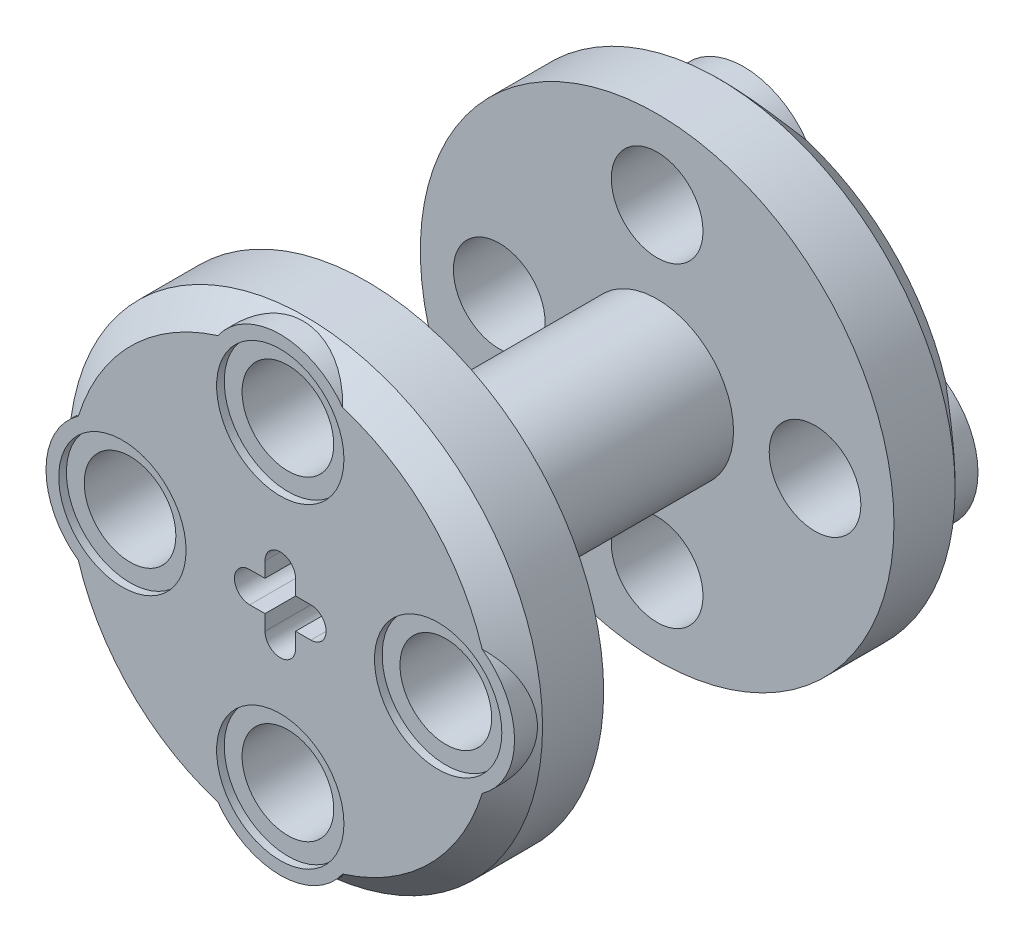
from build123d import *

# Parameters (mm, degrees)
SKETCH1_R           = 11.811
SKETCH1_R_2         = 2.286
EXTRUDE1_DEPTH      = 4.318
CHAMFER1_SIZE       = 1.27
EXTRUDE2_START      = -4.318
SKETCH2_R           = 2.794
SKETCH2_R_2         = 2.306678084
SKETCH2_R_3         = 2.286
SKETCH2_R_4         = 2.290860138
EXTRUDE2_DEPTH      = 4.318
SKETCH3_R           = 3.81
EXTRUDE3_DEPTH      = 7.239
SKETCH4_W           = 1.524
SKETCH4_H           = 1.524
CUT_EXTRUDE1_DEPTH  = 21.311664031
SKETCH5_R           = 3.81
SKETCH5_R_2         = 2.286
BOSS_EXTRUDE3_DEPTH = 4.318
BOSS_EXTRUDE5_START = -4.318
SKETCH6_R           = 3.81
SKETCH6_R_2         = 2.286
BOSS_EXTRUDE5_DEPTH = 4.318
SKETCH5_3_R         = 3.175
CUT_EXTRUDE2_DEPTH  = 0.381
CUT_EXTRUDE3_START  = -0.381
SKETCH6_3_R         = 3.175
CUT_EXTRUDE3_DEPTH  = 0.381
CIRPATTERN1_COUNT   = 4


with BuildPart() as part:
    # Sketch1 → Extrude1 (new body)
    with BuildSketch(Plane.XY):
        Circle(SKETCH1_R)
        with Locations((0, 7.874)):
            Circle(SKETCH1_R_2, mode=Mode.SUBTRACT)
        with Locations((7.874, 0)):
            Circle(SKETCH1_R_2, mode=Mode.SUBTRACT)
        with Locations((0, -7.874)):
            Circle(SKETCH1_R_2, mode=Mode.SUBTRACT)
        with Locations((-7.874, 0)):
            Circle(SKETCH1_R_2, mode=Mode.SUBTRACT)
    extrude(amount=EXTRUDE1_DEPTH)

    # Chamfer1
    chamfer1_edges = [part.edges().sort_by_distance(p)[0] for p in [
        (-11.811, 0, 4.318),
    ]]
    chamfer(chamfer1_edges, length=CHAMFER1_SIZE)

    # Sketch2 → Extrude2 (add)
    # profile 1 of 4: a face of its own
    with BuildSketch(Plane.XY.offset(4.318).offset(EXTRUDE2_START)):
        with Locations((0, 7.874)):
            Circle(SKETCH2_R)
        with Locations((0, 7.874)):
            Circle(SKETCH2_R_2, mode=Mode.SUBTRACT)
    # profile 2 of 4: a face of its own
    with BuildSketch(Plane.XY.offset(4.318).offset(EXTRUDE2_START)):
        with Locations((-7.874, 0)):
            Circle(SKETCH2_R)
        with Locations((-7.874, 0)):
            Circle(SKETCH2_R_3, mode=Mode.SUBTRACT)
    # profile 3 of 4: a face of its own
    with BuildSketch(Plane.XY.offset(4.318).offset(EXTRUDE2_START)):
        with Locations((0, -7.874)):
            Circle(SKETCH2_R)
        with Locations((0, -7.874)):
            Circle(SKETCH2_R_4, mode=Mode.SUBTRACT)
    # profile 4 of 4: a face of its own
    with BuildSketch(Plane.XY.offset(4.318).offset(EXTRUDE2_START)):
        with Locations((7.874, 0)):
            Circle(SKETCH2_R)
        with Locations((7.874, 0)):
            Circle(SKETCH2_R_3, mode=Mode.SUBTRACT)
    extrude(amount=EXTRUDE2_DEPTH)

    # Sketch3 → Extrude3 (add)
    with BuildSketch(Plane(origin=(0, 0, 0), x_dir=(-1, 0, 0), z_dir=(0, 0, -1))):
        with Locations(Location((0, 0, 0), (0, 0, 180))):
            Circle(SKETCH3_R)
    extrude(amount=EXTRUDE3_DEPTH)

    # Sketch4 → Cut-Extrude1 (cut, through all)
    with BuildSketch(Plane.XY.offset(4.318)):
        with BuildLine():
            Line((-0.762, 0.762), (-1.524, 0.762))
            ThreePointArc((-1.524, 0.762), (-2.286, 0), (-1.524, -0.762))
            Line((-1.524, -0.762), (-0.762, -0.762))
            Line((-0.762, -0.762), (-0.762, 0.762))
        make_face()
        with BuildLine():
            Line((-0.762, 1.524), (-0.762, 0.762))
            Line((-0.762, 0.762), (0.762, 0.762))
            Line((0.762, 0.762), (0.762, 1.524))
            ThreePointArc((0.762, 1.524), (0, 2.286), (-0.762, 1.524))
        make_face()
        with BuildLine():
            Line((1.524, 0.762), (0.762, 0.762))
            Line((0.762, 0.762), (0.762, -0.762))
            Line((0.762, -0.762), (1.524, -0.762))
            ThreePointArc((1.524, -0.762), (2.286, 0), (1.524, 0.762))
        make_face()
        Rectangle(SKETCH4_W, SKETCH4_H)
        with BuildLine():
            Line((0.762, -0.762), (-0.762, -0.762))
            Line((-0.762, -0.762), (-0.762, -1.524))
            ThreePointArc((-0.762, -1.524), (0, -2.286), (0.762, -1.524))
            Line((0.762, -1.524), (0.762, -0.762))
        make_face()
    extrude(amount=-CUT_EXTRUDE1_DEPTH, mode=Mode.SUBTRACT)

    # Mirror1: part across plane


with BuildPart() as part_1:
    add(part.part)
    add(part.part.mirror(Plane.XY.offset(-7.239)))

    # Sketch5 → Boss-Extrude3 (add)
    with BuildSketch(Plane.XY.offset(4.318)):
        with Locations((0, 7.874)):
            Circle(SKETCH5_R)
        with Locations((0, 7.874)):
            Circle(SKETCH5_R_2, mode=Mode.SUBTRACT)
    boss_extrude3 = extrude(amount=-BOSS_EXTRUDE3_DEPTH)

    # Sketch6 → Boss-Extrude5 (add)
    with BuildSketch(Plane(origin=(0, 0, -18.796), x_dir=(-1, 0, 0), z_dir=(0, 0, -1)).offset(BOSS_EXTRUDE5_START)):
        with Locations((0, 7.874)):
            Circle(SKETCH6_R)
        with Locations(Location((0, 7.874, 0), (0, 0, 180))):
            Circle(SKETCH6_R_2, mode=Mode.SUBTRACT)
    boss_extrude5 = extrude(amount=BOSS_EXTRUDE5_DEPTH)

    # Sketch5_3 → Cut-Extrude2 (cut)
    with BuildSketch(Plane.XY.offset(4.318)):
        with Locations((0, 7.874)):
            Circle(SKETCH5_3_R)
    cut_extrude2 = extrude(amount=-CUT_EXTRUDE2_DEPTH, mode=Mode.SUBTRACT)

    # Sketch6_3 → Cut-Extrude3 (cut)
    with BuildSketch(Plane(origin=(0, 0, -18.796), x_dir=(-1, 0, 0), z_dir=(0, 0, -1)).offset(CUT_EXTRUDE3_START)):
        with Locations(Location((0, 7.874, 0), (0, 0, 180))):
            Circle(SKETCH6_3_R)
    cut_extrude3 = extrude(amount=CUT_EXTRUDE3_DEPTH, mode=Mode.SUBTRACT)

    # CirPattern1: Boss-Extrude3, Boss-Extrude5, Cut-Extrude2, Cut-Extrude3 ×4 about axis
    cirpattern1_axis = Axis((0, 0, 0), (0, 0, 1))
    add([boss_extrude3.rotate(cirpattern1_axis, i * 360 / CIRPATTERN1_COUNT) for i in range(1, CIRPATTERN1_COUNT)])
    add([boss_extrude5.rotate(cirpattern1_axis, i * 360 / CIRPATTERN1_COUNT) for i in range(1, CIRPATTERN1_COUNT)])
    add([cut_extrude2.rotate(cirpattern1_axis, i * 360 / CIRPATTERN1_COUNT) for i in range(1, CIRPATTERN1_COUNT)], mode=Mode.SUBTRACT)
    add([cut_extrude3.rotate(cirpattern1_axis, i * 360 / CIRPATTERN1_COUNT) for i in range(1, CIRPATTERN1_COUNT)], mode=Mode.SUBTRACT)


solid = part_1.part
